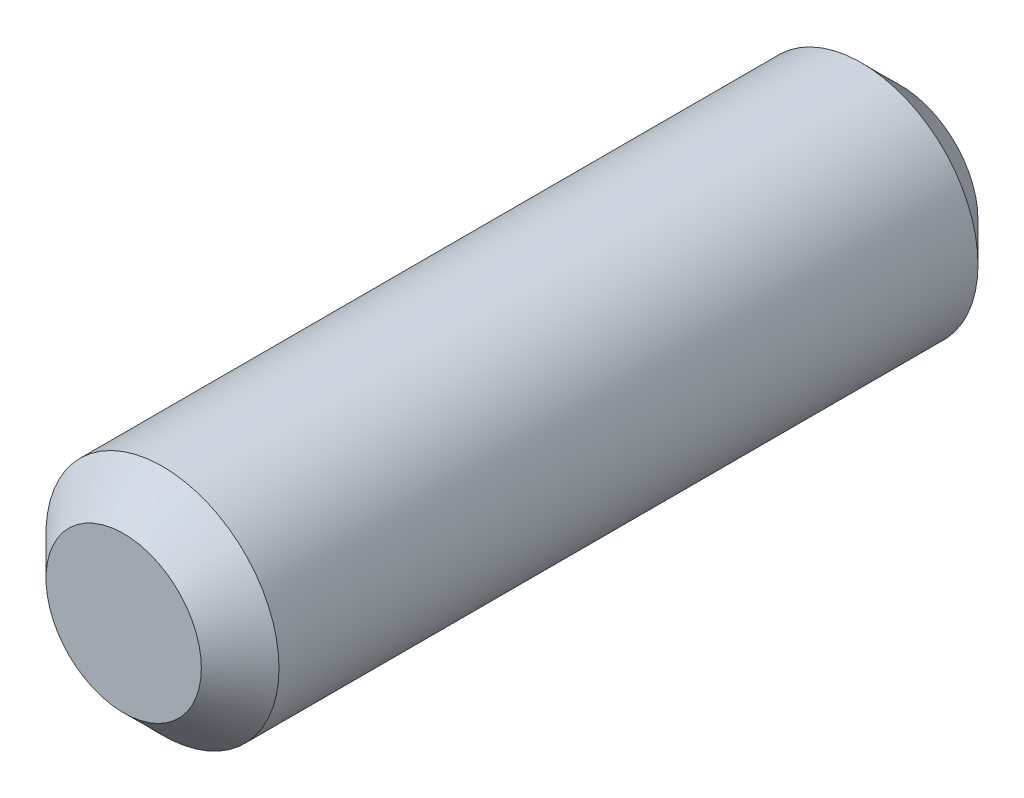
from build123d import *

# Parameters (mm, degrees)
ESQUISSE1_R            = 1.5
CYLINDRE_DE_BASE_DEPTH = 5
CHANFREIN1_SIZE        = 0.5


with BuildPart() as part:
    # Esquisse1 → Cylindre de base (new, symmetric)
    with BuildSketch(Plane.XY):
        Circle(ESQUISSE1_R)
    extrude(amount=CYLINDRE_DE_BASE_DEPTH, both=True)

    # Chanfrein1
    chanfrein1_edges = [part.edges().sort_by_distance(p)[0] for p in [
        (-1.5, 0, -5),
        (-1.5, 0, 5),
    ]]
    chamfer(chanfrein1_edges, length=CHANFREIN1_SIZE)


solid = part.part
